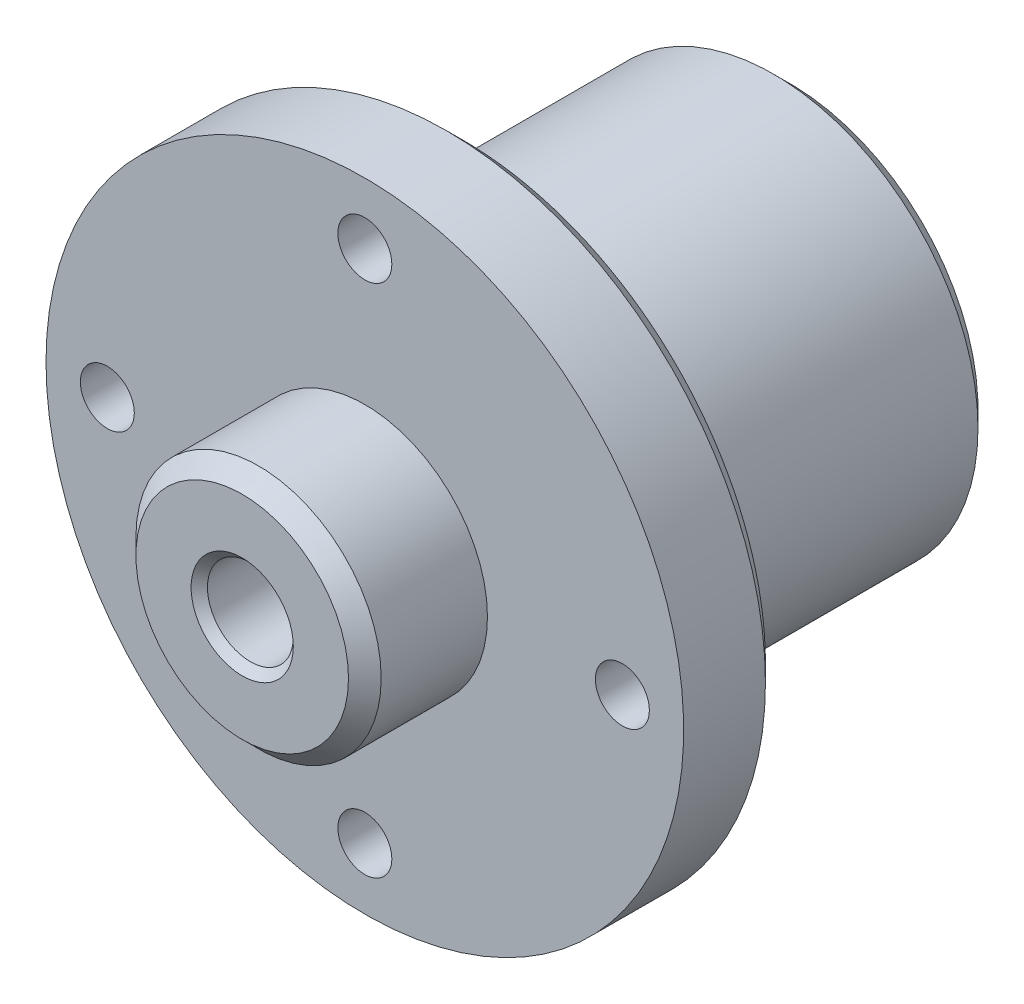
ISO-10303-21;
HEADER;
FILE_DESCRIPTION(('STEP AP214'),'2;1');
FILE_NAME('part.step','',(''),(''),'','','');
FILE_SCHEMA(('AUTOMOTIVE_DESIGN { 1 0 10303 214 1 1 1 1 }'));
ENDSEC;
DATA;
#1=APPLICATION_CONTEXT('core data for automotive mechanical design processes');
#2=APPLICATION_PROTOCOL_DEFINITION('international standard','automotive_design',2000,#1);
#3=PRODUCT_CONTEXT('',#1,'mechanical');
#4=PRODUCT('Part','Part','',(#3));
#5=PRODUCT_RELATED_PRODUCT_CATEGORY('part','',(#4));
#6=PRODUCT_DEFINITION_FORMATION('','',#4);
#7=PRODUCT_DEFINITION_CONTEXT('part definition',#1,'design');
#8=PRODUCT_DEFINITION('design','',#6,#7);
#9=PRODUCT_DEFINITION_SHAPE('','',#8);
#10=(LENGTH_UNIT() NAMED_UNIT(*) SI_UNIT(.MILLI.,.METRE.));
#11=(NAMED_UNIT(*) PLANE_ANGLE_UNIT() SI_UNIT($,.RADIAN.));
#12=(NAMED_UNIT(*) SI_UNIT($,.STERADIAN.) SOLID_ANGLE_UNIT());
#13=UNCERTAINTY_MEASURE_WITH_UNIT(LENGTH_MEASURE(1.E-05),#10,'distance_accuracy_value','');
#14=(GEOMETRIC_REPRESENTATION_CONTEXT(3) GLOBAL_UNCERTAINTY_ASSIGNED_CONTEXT((#13)) GLOBAL_UNIT_ASSIGNED_CONTEXT((#10,
#11,#12)) REPRESENTATION_CONTEXT('',''));
#15=CARTESIAN_POINT('',(0.,0.,0.));
#16=DIRECTION('',(0.,0.,1.));
#17=DIRECTION('',(1.,0.,0.));
#18=AXIS2_PLACEMENT_3D('',#15,#16,#17);
#19=CARTESIAN_POINT('',(0.,0.,-54.6973544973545));
#20=DIRECTION('',(0.,0.,-1.));
#21=DIRECTION('',(-1.,0.,0.));
#22=AXIS2_PLACEMENT_3D('',#19,#20,#21);
#23=CYLINDRICAL_SURFACE('',#22,5.24999999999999);
#24=CARTESIAN_POINT('',(0.,0.,14.));
#25=DIRECTION('',(0.,0.,1.));
#26=DIRECTION('',(1.,0.,0.));
#27=AXIS2_PLACEMENT_3D('',#24,#25,#26);
#28=CIRCLE('',#27,5.24999999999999);
#29=CARTESIAN_POINT('',(5.25000000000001,0.,14.));
#30=VERTEX_POINT('',#29);
#31=EDGE_CURVE('E44',#30,#30,#28,.T.);
#32=ORIENTED_EDGE('',*,*,#31,.T.);
#33=EDGE_LOOP('',(#32));
#34=FACE_BOUND('',#33,.T.);
#35=CARTESIAN_POINT('',(0.,0.,-51.));
#36=DIRECTION('',(0.,0.,-1.));
#37=DIRECTION('',(-1.,0.,0.));
#38=AXIS2_PLACEMENT_3D('',#35,#36,#37);
#39=CIRCLE('',#38,5.24999999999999);
#40=CARTESIAN_POINT('',(-5.25000000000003,0.,-51.));
#41=VERTEX_POINT('',#40);
#42=EDGE_CURVE('E117',#41,#41,#39,.T.);
#43=ORIENTED_EDGE('',*,*,#42,.T.);
#44=EDGE_LOOP('',(#43));
#45=FACE_BOUND('',#44,.T.);
#46=ADVANCED_FACE('F36',(#34,#45),#23,.F.);
#47=CARTESIAN_POINT('',(-5.25000000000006,0.,-52.));
#48=DIRECTION('',(0.,0.,-1.));
#49=DIRECTION('',(-1.,0.,0.));
#50=AXIS2_PLACEMENT_3D('',#47,#48,#49);
#51=PLANE('',#50);
#52=CARTESIAN_POINT('',(0.,0.,-52.));
#53=DIRECTION('',(0.,0.,-1.));
#54=DIRECTION('',(-1.,0.,0.));
#55=AXIS2_PLACEMENT_3D('',#52,#53,#54);
#56=CIRCLE('',#55,6.25);
#57=CARTESIAN_POINT('',(-6.25000000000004,0.,-52.));
#58=VERTEX_POINT('',#57);
#59=EDGE_CURVE('E11',#58,#58,#56,.F.);
#60=ORIENTED_EDGE('',*,*,#59,.T.);
#61=EDGE_LOOP('',(#60));
#62=FACE_BOUND('',#61,.T.);
#63=CARTESIAN_POINT('',(0.,0.,-52.));
#64=DIRECTION('',(0.,0.,-1.));
#65=DIRECTION('',(-1.,0.,0.));
#66=AXIS2_PLACEMENT_3D('',#63,#64,#65);
#67=CIRCLE('',#66,23.);
#68=CARTESIAN_POINT('',(-23.,1.49545661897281E-13,-52.));
#69=VERTEX_POINT('',#68);
#70=EDGE_CURVE('E108',#69,#69,#67,.T.);
#71=ORIENTED_EDGE('',*,*,#70,.T.);
#72=EDGE_LOOP('',(#71));
#73=FACE_BOUND('',#72,.T.);
#74=ADVANCED_FACE('F164',(#62,#73),#51,.T.);
#75=CARTESIAN_POINT('',(0.,0.,-54.6973544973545));
#76=DIRECTION('',(0.,0.,-1.));
#77=DIRECTION('',(-1.,0.,0.));
#78=AXIS2_PLACEMENT_3D('',#75,#76,#77);
#79=CYLINDRICAL_SURFACE('',#78,25.);
#80=CARTESIAN_POINT('',(0.,0.,-50.));
#81=DIRECTION('',(0.,0.,-1.));
#82=DIRECTION('',(-1.,0.,0.));
#83=AXIS2_PLACEMENT_3D('',#80,#81,#82);
#84=CIRCLE('',#83,25.);
#85=CARTESIAN_POINT('',(-25.0000000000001,1.59166224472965E-13,-50.));
#86=VERTEX_POINT('',#85);
#87=EDGE_CURVE('E111',#86,#86,#84,.F.);
#88=ORIENTED_EDGE('',*,*,#87,.T.);
#89=EDGE_LOOP('',(#88));
#90=FACE_BOUND('',#89,.T.);
#91=CARTESIAN_POINT('',(0.,0.,-12.));
#92=DIRECTION('',(0.,0.,-1.));
#93=DIRECTION('',(-1.,0.,0.));
#94=AXIS2_PLACEMENT_3D('',#91,#92,#93);
#95=CIRCLE('',#94,25.);
#96=CARTESIAN_POINT('',(-25.,1.39452233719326E-13,-12.));
#97=VERTEX_POINT('',#96);
#98=EDGE_CURVE('E75',#97,#97,#95,.T.);
#99=ORIENTED_EDGE('',*,*,#98,.T.);
#100=EDGE_LOOP('',(#99));
#101=FACE_BOUND('',#100,.T.);
#102=ADVANCED_FACE('F169',(#90,#101),#79,.T.);
#103=CARTESIAN_POINT('',(-25.0000000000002,1.60108810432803E-13,-12.));
#104=DIRECTION('',(0.,0.,-1.));
#105=DIRECTION('',(-1.,0.,0.));
#106=AXIS2_PLACEMENT_3D('',#103,#104,#105);
#107=PLANE('',#106);
#108=CARTESIAN_POINT('',(0.,0.,-12.));
#109=DIRECTION('',(0.,0.,-1.));
#110=DIRECTION('',(-1.,0.,0.));
#111=AXIS2_PLACEMENT_3D('',#108,#109,#110);
#112=CIRCLE('',#111,37.);
#113=CARTESIAN_POINT('',(-37.,-1.01834434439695E-13,-12.));
#114=VERTEX_POINT('',#113);
#115=CARTESIAN_POINT('',(0.,37.,-12.));
#116=VERTEX_POINT('',#115);
#117=EDGE_CURVE('E77',#114,#116,#112,.T.);
#118=ORIENTED_EDGE('',*,*,#117,.T.);
#119=CARTESIAN_POINT('',(0.,31.5,-12.));
#120=DIRECTION('',(0.,0.,-1.));
#121=DIRECTION('',(-1.,0.,0.));
#122=AXIS2_PLACEMENT_3D('',#119,#120,#121);
#123=CIRCLE('',#122,5.5);
#124=EDGE_CURVE('E50',#116,#116,#123,.T.);
#125=ORIENTED_EDGE('',*,*,#124,.F.);
#126=CARTESIAN_POINT('',(37.0000000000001,-2.47551206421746E-13,-12.));
#127=VERTEX_POINT('',#126);
#128=EDGE_CURVE('E56',#116,#127,#112,.T.);
#129=ORIENTED_EDGE('',*,*,#128,.T.);
#130=CARTESIAN_POINT('',(31.5,-1.29590010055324E-13,-12.));
#131=DIRECTION('',(0.,0.,-1.));
#132=DIRECTION('',(-1.,0.,0.));
#133=AXIS2_PLACEMENT_3D('',#130,#131,#132);
#134=CIRCLE('',#133,5.5);
#135=EDGE_CURVE('E73',#127,#127,#134,.T.);
#136=ORIENTED_EDGE('',*,*,#135,.F.);
#137=CARTESIAN_POINT('',(2.5451666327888E-13,-37.0000000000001,-12.));
#138=VERTEX_POINT('',#137);
#139=EDGE_CURVE('E65',#127,#138,#112,.T.);
#140=ORIENTED_EDGE('',*,*,#139,.T.);
#141=CARTESIAN_POINT('',(2.26761087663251E-13,-31.5,-12.));
#142=DIRECTION('',(0.,0.,-1.));
#143=DIRECTION('',(-1.,0.,0.));
#144=AXIS2_PLACEMENT_3D('',#141,#142,#143);
#145=CIRCLE('',#144,5.5);
#146=EDGE_CURVE('E71',#138,#138,#145,.T.);
#147=ORIENTED_EDGE('',*,*,#146,.F.);
#148=EDGE_CURVE('E97',#138,#114,#112,.T.);
#149=ORIENTED_EDGE('',*,*,#148,.T.);
#150=CARTESIAN_POINT('',(-31.5,0.,-12.));
#151=DIRECTION('',(0.,0.,-1.));
#152=DIRECTION('',(-1.,0.,0.));
#153=AXIS2_PLACEMENT_3D('',#150,#151,#152);
#154=CIRCLE('',#153,5.5);
#155=EDGE_CURVE('E124',#114,#114,#154,.T.);
#156=ORIENTED_EDGE('',*,*,#155,.F.);
#157=EDGE_LOOP('',(#118,#125,#129,#136,#140,#147,#149,#156));
#158=FACE_BOUND('',#157,.T.);
#159=ORIENTED_EDGE('',*,*,#98,.F.);
#160=EDGE_LOOP('',(#159));
#161=FACE_BOUND('',#160,.T.);
#162=ADVANCED_FACE('F68',(#158,#161),#107,.T.);
#163=CARTESIAN_POINT('',(0.,0.,-54.6973544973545));
#164=DIRECTION('',(0.,0.,-1.));
#165=DIRECTION('',(-1.,0.,0.));
#166=AXIS2_PLACEMENT_3D('',#163,#164,#165);
#167=CYLINDRICAL_SURFACE('',#166,39.);
#168=CARTESIAN_POINT('',(0.,0.,-9.99999999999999));
#169=DIRECTION('',(0.,0.,-1.));
#170=DIRECTION('',(-1.,0.,0.));
#171=AXIS2_PLACEMENT_3D('',#168,#169,#170);
#172=CIRCLE('',#171,39.);
#173=CARTESIAN_POINT('',(-39.,2.13021642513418E-13,-10.));
#174=VERTEX_POINT('',#173);
#175=EDGE_CURVE('E99',#174,#174,#172,.F.);
#176=ORIENTED_EDGE('',*,*,#175,.T.);
#177=EDGE_LOOP('',(#176));
#178=FACE_BOUND('',#177,.T.);
#179=CARTESIAN_POINT('',(0.,0.,0.));
#180=DIRECTION('',(0.,0.,-1.));
#181=DIRECTION('',(-1.,0.,0.));
#182=AXIS2_PLACEMENT_3D('',#179,#180,#181);
#183=CIRCLE('',#182,39.);
#184=CARTESIAN_POINT('',(-39.,2.07833750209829E-13,0.));
#185=VERTEX_POINT('',#184);
#186=EDGE_CURVE('E93',#185,#185,#183,.T.);
#187=ORIENTED_EDGE('',*,*,#186,.T.);
#188=EDGE_LOOP('',(#187));
#189=FACE_BOUND('',#188,.T.);
#190=ADVANCED_FACE('F204',(#178,#189),#167,.T.);
#191=CARTESIAN_POINT('',(-39.0000000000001,0.,0.));
#192=DIRECTION('',(0.,0.,1.));
#193=DIRECTION('',(1.,0.,0.));
#194=AXIS2_PLACEMENT_3D('',#191,#192,#193);
#195=PLANE('',#194);
#196=CARTESIAN_POINT('',(0.,31.5,0.));
#197=DIRECTION('',(0.,0.,1.));
#198=DIRECTION('',(1.,0.,0.));
#199=AXIS2_PLACEMENT_3D('',#196,#197,#198);
#200=CIRCLE('',#199,3.3);
#201=CARTESIAN_POINT('',(3.29999999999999,31.5,0.));
#202=VERTEX_POINT('',#201);
#203=EDGE_CURVE('E39',#202,#202,#200,.T.);
#204=ORIENTED_EDGE('',*,*,#203,.F.);
#205=EDGE_LOOP('',(#204));
#206=FACE_BOUND('',#205,.T.);
#207=CARTESIAN_POINT('',(31.5,-1.29590010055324E-13,0.));
#208=DIRECTION('',(0.,0.,1.));
#209=DIRECTION('',(1.,0.,0.));
#210=AXIS2_PLACEMENT_3D('',#207,#208,#209);
#211=CIRCLE('',#210,3.3);
#212=CARTESIAN_POINT('',(34.8,-1.47175942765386E-13,0.));
#213=VERTEX_POINT('',#212);
#214=EDGE_CURVE('E125',#213,#213,#211,.T.);
#215=ORIENTED_EDGE('',*,*,#214,.F.);
#216=EDGE_LOOP('',(#215));
#217=FACE_BOUND('',#216,.T.);
#218=CARTESIAN_POINT('',(-31.5,0.,0.));
#219=DIRECTION('',(0.,0.,1.));
#220=DIRECTION('',(1.,0.,0.));
#221=AXIS2_PLACEMENT_3D('',#218,#219,#220);
#222=CIRCLE('',#221,3.3);
#223=CARTESIAN_POINT('',(-28.2,0.,0.));
#224=VERTEX_POINT('',#223);
#225=EDGE_CURVE('E122',#224,#224,#222,.T.);
#226=ORIENTED_EDGE('',*,*,#225,.F.);
#227=EDGE_LOOP('',(#226));
#228=FACE_BOUND('',#227,.T.);
#229=CARTESIAN_POINT('',(2.26761087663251E-13,-31.5,0.));
#230=DIRECTION('',(0.,0.,1.));
#231=DIRECTION('',(1.,0.,0.));
#232=AXIS2_PLACEMENT_3D('',#229,#230,#231);
#233=CIRCLE('',#232,3.3);
#234=CARTESIAN_POINT('',(3.30000000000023,-31.5000000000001,0.));
#235=VERTEX_POINT('',#234);
#236=EDGE_CURVE('E80',#235,#235,#233,.T.);
#237=ORIENTED_EDGE('',*,*,#236,.F.);
#238=EDGE_LOOP('',(#237));
#239=FACE_BOUND('',#238,.T.);
#240=CARTESIAN_POINT('',(0.,0.,0.));
#241=DIRECTION('',(0.,0.,-1.));
#242=DIRECTION('',(-1.,0.,0.));
#243=AXIS2_PLACEMENT_3D('',#240,#241,#242);
#244=CIRCLE('',#243,15.);
#245=CARTESIAN_POINT('',(-15.,0.,0.));
#246=VERTEX_POINT('',#245);
#247=EDGE_CURVE('E84',#246,#246,#244,.T.);
#248=ORIENTED_EDGE('',*,*,#247,.T.);
#249=EDGE_LOOP('',(#248));
#250=FACE_BOUND('',#249,.T.);
#251=ORIENTED_EDGE('',*,*,#186,.F.);
#252=EDGE_LOOP('',(#251));
#253=FACE_BOUND('',#252,.T.);
#254=ADVANCED_FACE('F198',(#206,#217,#228,#239,#250,#253),#195,.T.);
#255=CARTESIAN_POINT('',(0.,0.,-54.6973544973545));
#256=DIRECTION('',(0.,0.,-1.));
#257=DIRECTION('',(-1.,0.,0.));
#258=AXIS2_PLACEMENT_3D('',#255,#256,#257);
#259=CYLINDRICAL_SURFACE('',#258,15.);
#260=CARTESIAN_POINT('',(0.,0.,13.));
#261=DIRECTION('',(0.,0.,1.));
#262=DIRECTION('',(1.,0.,0.));
#263=AXIS2_PLACEMENT_3D('',#260,#261,#262);
#264=CIRCLE('',#263,15.);
#265=CARTESIAN_POINT('',(15.,0.,13.));
#266=VERTEX_POINT('',#265);
#267=EDGE_CURVE('E102',#266,#266,#264,.F.);
#268=ORIENTED_EDGE('',*,*,#267,.T.);
#269=EDGE_LOOP('',(#268));
#270=FACE_BOUND('',#269,.T.);
#271=ORIENTED_EDGE('',*,*,#247,.F.);
#272=EDGE_LOOP('',(#271));
#273=FACE_BOUND('',#272,.T.);
#274=ADVANCED_FACE('F186',(#270,#273),#259,.T.);
#275=CARTESIAN_POINT('',(-15.,0.,15.));
#276=DIRECTION('',(0.,0.,1.));
#277=DIRECTION('',(1.,0.,0.));
#278=AXIS2_PLACEMENT_3D('',#275,#276,#277);
#279=PLANE('',#278);
#280=CARTESIAN_POINT('',(0.,0.,15.));
#281=DIRECTION('',(0.,0.,1.));
#282=DIRECTION('',(1.,0.,0.));
#283=AXIS2_PLACEMENT_3D('',#280,#281,#282);
#284=CIRCLE('',#283,6.25000000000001);
#285=CARTESIAN_POINT('',(6.25000000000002,0.,15.));
#286=VERTEX_POINT('',#285);
#287=EDGE_CURVE('E114',#286,#286,#284,.F.);
#288=ORIENTED_EDGE('',*,*,#287,.T.);
#289=EDGE_LOOP('',(#288));
#290=FACE_BOUND('',#289,.T.);
#291=CARTESIAN_POINT('',(0.,0.,15.));
#292=DIRECTION('',(0.,0.,1.));
#293=DIRECTION('',(1.,0.,0.));
#294=AXIS2_PLACEMENT_3D('',#291,#292,#293);
#295=CIRCLE('',#294,13.);
#296=CARTESIAN_POINT('',(13.,0.,15.));
#297=VERTEX_POINT('',#296);
#298=EDGE_CURVE('E105',#297,#297,#295,.T.);
#299=ORIENTED_EDGE('',*,*,#298,.T.);
#300=EDGE_LOOP('',(#299));
#301=FACE_BOUND('',#300,.T.);
#302=ADVANCED_FACE('F182',(#290,#301),#279,.T.);
#303=CARTESIAN_POINT('',(0.,0.,-12.));
#304=DIRECTION('',(0.,0.,1.));
#305=DIRECTION('',(1.,0.,0.));
#306=AXIS2_PLACEMENT_3D('',#303,#304,#305);
#307=CONICAL_SURFACE('',#306,37.,0.785398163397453);
#308=ORIENTED_EDGE('',*,*,#175,.F.);
#309=EDGE_LOOP('',(#308));
#310=FACE_BOUND('',#309,.T.);
#311=ORIENTED_EDGE('',*,*,#148,.F.);
#312=ORIENTED_EDGE('',*,*,#139,.F.);
#313=ORIENTED_EDGE('',*,*,#128,.F.);
#314=ORIENTED_EDGE('',*,*,#117,.F.);
#315=EDGE_LOOP('',(#311,#312,#313,#314));
#316=FACE_BOUND('',#315,.T.);
#317=ADVANCED_FACE('F185',(#310,#316),#307,.T.);
#318=CARTESIAN_POINT('',(0.,0.,13.));
#319=DIRECTION('',(0.,0.,-1.));
#320=DIRECTION('',(-1.,0.,0.));
#321=AXIS2_PLACEMENT_3D('',#318,#319,#320);
#322=CONICAL_SURFACE('',#321,15.,0.785398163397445);
#323=ORIENTED_EDGE('',*,*,#298,.F.);
#324=EDGE_LOOP('',(#323));
#325=FACE_BOUND('',#324,.T.);
#326=ORIENTED_EDGE('',*,*,#267,.F.);
#327=EDGE_LOOP('',(#326));
#328=FACE_BOUND('',#327,.T.);
#329=ADVANCED_FACE('F190',(#325,#328),#322,.T.);
#330=CARTESIAN_POINT('',(0.,0.,-52.));
#331=DIRECTION('',(0.,0.,1.));
#332=DIRECTION('',(1.,0.,0.));
#333=AXIS2_PLACEMENT_3D('',#330,#331,#332);
#334=CONICAL_SURFACE('',#333,23.,0.785398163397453);
#335=ORIENTED_EDGE('',*,*,#87,.F.);
#336=EDGE_LOOP('',(#335));
#337=FACE_BOUND('',#336,.T.);
#338=ORIENTED_EDGE('',*,*,#70,.F.);
#339=EDGE_LOOP('',(#338));
#340=FACE_BOUND('',#339,.T.);
#341=ADVANCED_FACE('F178',(#337,#340),#334,.T.);
#342=CARTESIAN_POINT('',(0.,0.,15.));
#343=DIRECTION('',(0.,0.,1.));
#344=DIRECTION('',(1.,0.,0.));
#345=AXIS2_PLACEMENT_3D('',#342,#343,#344);
#346=CONICAL_SURFACE('',#345,6.25,0.785398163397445);
#347=ORIENTED_EDGE('',*,*,#31,.F.);
#348=EDGE_LOOP('',(#347));
#349=FACE_BOUND('',#348,.T.);
#350=ORIENTED_EDGE('',*,*,#287,.F.);
#351=EDGE_LOOP('',(#350));
#352=FACE_BOUND('',#351,.T.);
#353=ADVANCED_FACE('F160',(#349,#352),#346,.F.);
#354=CARTESIAN_POINT('',(0.,0.,-51.));
#355=DIRECTION('',(0.,0.,-1.));
#356=DIRECTION('',(-1.,0.,0.));
#357=AXIS2_PLACEMENT_3D('',#354,#355,#356);
#358=CONICAL_SURFACE('',#357,5.24999999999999,0.785398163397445);
#359=ORIENTED_EDGE('',*,*,#59,.F.);
#360=EDGE_LOOP('',(#359));
#361=FACE_BOUND('',#360,.T.);
#362=ORIENTED_EDGE('',*,*,#42,.F.);
#363=EDGE_LOOP('',(#362));
#364=FACE_BOUND('',#363,.T.);
#365=ADVANCED_FACE('F155',(#361,#364),#358,.F.);
#366=CARTESIAN_POINT('',(2.26761087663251E-13,-31.5,-12.));
#367=DIRECTION('',(0.,0.,-1.));
#368=DIRECTION('',(-1.,0.,0.));
#369=AXIS2_PLACEMENT_3D('',#366,#367,#368);
#370=CYLINDRICAL_SURFACE('',#369,5.5);
#371=CARTESIAN_POINT('',(2.26761087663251E-13,-31.5,-6.00000000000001));
#372=DIRECTION('',(0.,0.,-1.));
#373=DIRECTION('',(-1.,0.,0.));
#374=AXIS2_PLACEMENT_3D('',#371,#372,#373);
#375=CIRCLE('',#374,5.5);
#376=CARTESIAN_POINT('',(-5.49999999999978,-31.5,-6.00000000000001));
#377=VERTEX_POINT('',#376);
#378=EDGE_CURVE('E81',#377,#377,#375,.T.);
#379=ORIENTED_EDGE('',*,*,#378,.F.);
#380=EDGE_LOOP('',(#379));
#381=FACE_BOUND('',#380,.T.);
#382=ORIENTED_EDGE('',*,*,#146,.T.);
#383=EDGE_LOOP('',(#382));
#384=FACE_BOUND('',#383,.T.);
#385=ADVANCED_FACE('F79',(#381,#384),#370,.F.);
#386=CARTESIAN_POINT('',(3.30000000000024,-31.5000000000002,-6.00000000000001));
#387=DIRECTION('',(0.,0.,1.));
#388=DIRECTION('',(1.,0.,0.));
#389=AXIS2_PLACEMENT_3D('',#386,#387,#388);
#390=PLANE('',#389);
#391=CARTESIAN_POINT('',(2.26761087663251E-13,-31.5,-6.00000000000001));
#392=DIRECTION('',(0.,0.,-1.));
#393=DIRECTION('',(-1.,0.,0.));
#394=AXIS2_PLACEMENT_3D('',#391,#392,#393);
#395=CIRCLE('',#394,3.3);
#396=CARTESIAN_POINT('',(-3.29999999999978,-31.5,-6.00000000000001));
#397=VERTEX_POINT('',#396);
#398=EDGE_CURVE('E87',#397,#397,#395,.T.);
#399=ORIENTED_EDGE('',*,*,#398,.F.);
#400=EDGE_LOOP('',(#399));
#401=FACE_BOUND('',#400,.T.);
#402=ORIENTED_EDGE('',*,*,#378,.T.);
#403=EDGE_LOOP('',(#402));
#404=FACE_BOUND('',#403,.T.);
#405=ADVANCED_FACE('F148',(#401,#404),#390,.F.);
#406=CARTESIAN_POINT('',(2.26761087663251E-13,-31.5,-12.));
#407=DIRECTION('',(0.,0.,-1.));
#408=DIRECTION('',(-1.,0.,0.));
#409=AXIS2_PLACEMENT_3D('',#406,#407,#408);
#410=CYLINDRICAL_SURFACE('',#409,3.3);
#411=ORIENTED_EDGE('',*,*,#236,.T.);
#412=EDGE_LOOP('',(#411));
#413=FACE_BOUND('',#412,.T.);
#414=ORIENTED_EDGE('',*,*,#398,.T.);
#415=EDGE_LOOP('',(#414));
#416=FACE_BOUND('',#415,.T.);
#417=ADVANCED_FACE('F146',(#413,#416),#410,.F.);
#418=CARTESIAN_POINT('',(-31.5,0.,-12.));
#419=DIRECTION('',(0.,0.,-1.));
#420=DIRECTION('',(-1.,0.,0.));
#421=AXIS2_PLACEMENT_3D('',#418,#419,#420);
#422=CYLINDRICAL_SURFACE('',#421,5.5);
#423=CARTESIAN_POINT('',(-31.5,0.,-6.00000000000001));
#424=DIRECTION('',(0.,0.,-1.));
#425=DIRECTION('',(-1.,0.,0.));
#426=AXIS2_PLACEMENT_3D('',#423,#424,#425);
#427=CIRCLE('',#426,5.5);
#428=CARTESIAN_POINT('',(-37.,0.,-6.00000000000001));
#429=VERTEX_POINT('',#428);
#430=EDGE_CURVE('E131',#429,#429,#427,.T.);
#431=ORIENTED_EDGE('',*,*,#430,.F.);
#432=EDGE_LOOP('',(#431));
#433=FACE_BOUND('',#432,.T.);
#434=ORIENTED_EDGE('',*,*,#155,.T.);
#435=EDGE_LOOP('',(#434));
#436=FACE_BOUND('',#435,.T.);
#437=ADVANCED_FACE('F241',(#433,#436),#422,.F.);
#438=CARTESIAN_POINT('',(-28.2000000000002,0.,-6.00000000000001));
#439=DIRECTION('',(0.,0.,1.));
#440=DIRECTION('',(1.,0.,0.));
#441=AXIS2_PLACEMENT_3D('',#438,#439,#440);
#442=PLANE('',#441);
#443=CARTESIAN_POINT('',(-31.5,0.,-6.00000000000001));
#444=DIRECTION('',(0.,0.,-1.));
#445=DIRECTION('',(-1.,0.,0.));
#446=AXIS2_PLACEMENT_3D('',#443,#444,#445);
#447=CIRCLE('',#446,3.3);
#448=CARTESIAN_POINT('',(-34.8,0.,-6.00000000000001));
#449=VERTEX_POINT('',#448);
#450=EDGE_CURVE('E127',#449,#449,#447,.T.);
#451=ORIENTED_EDGE('',*,*,#450,.F.);
#452=EDGE_LOOP('',(#451));
#453=FACE_BOUND('',#452,.T.);
#454=ORIENTED_EDGE('',*,*,#430,.T.);
#455=EDGE_LOOP('',(#454));
#456=FACE_BOUND('',#455,.T.);
#457=ADVANCED_FACE('F243',(#453,#456),#442,.F.);
#458=CARTESIAN_POINT('',(-31.5,0.,-12.));
#459=DIRECTION('',(0.,0.,-1.));
#460=DIRECTION('',(-1.,0.,0.));
#461=AXIS2_PLACEMENT_3D('',#458,#459,#460);
#462=CYLINDRICAL_SURFACE('',#461,3.3);
#463=ORIENTED_EDGE('',*,*,#225,.T.);
#464=EDGE_LOOP('',(#463));
#465=FACE_BOUND('',#464,.T.);
#466=ORIENTED_EDGE('',*,*,#450,.T.);
#467=EDGE_LOOP('',(#466));
#468=FACE_BOUND('',#467,.T.);
#469=ADVANCED_FACE('F250',(#465,#468),#462,.F.);
#470=CARTESIAN_POINT('',(31.5,-1.29590010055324E-13,-12.));
#471=DIRECTION('',(0.,0.,-1.));
#472=DIRECTION('',(-1.,0.,0.));
#473=AXIS2_PLACEMENT_3D('',#470,#471,#472);
#474=CYLINDRICAL_SURFACE('',#473,5.5);
#475=CARTESIAN_POINT('',(31.5,-1.29590010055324E-13,-6.00000000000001));
#476=DIRECTION('',(0.,0.,-1.));
#477=DIRECTION('',(-1.,0.,0.));
#478=AXIS2_PLACEMENT_3D('',#475,#476,#477);
#479=CIRCLE('',#478,5.5);
#480=CARTESIAN_POINT('',(26.,-1.00280122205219E-13,-6.00000000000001));
#481=VERTEX_POINT('',#480);
#482=EDGE_CURVE('E133',#481,#481,#479,.T.);
#483=ORIENTED_EDGE('',*,*,#482,.F.);
#484=EDGE_LOOP('',(#483));
#485=FACE_BOUND('',#484,.T.);
#486=ORIENTED_EDGE('',*,*,#135,.T.);
#487=EDGE_LOOP('',(#486));
#488=FACE_BOUND('',#487,.T.);
#489=ADVANCED_FACE('F259',(#485,#488),#474,.F.);
#490=CARTESIAN_POINT('',(34.8000000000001,-2.40612312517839E-13,-6.00000000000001));
#491=DIRECTION('',(0.,0.,1.));
#492=DIRECTION('',(1.,0.,0.));
#493=AXIS2_PLACEMENT_3D('',#490,#491,#492);
#494=PLANE('',#493);
#495=CARTESIAN_POINT('',(31.5,-1.29590010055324E-13,-6.00000000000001));
#496=DIRECTION('',(0.,0.,-1.));
#497=DIRECTION('',(-1.,0.,0.));
#498=AXIS2_PLACEMENT_3D('',#495,#496,#497);
#499=CIRCLE('',#498,3.3);
#500=CARTESIAN_POINT('',(28.2,-1.12004077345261E-13,-6.00000000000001));
#501=VERTEX_POINT('',#500);
#502=EDGE_CURVE('E137',#501,#501,#499,.T.);
#503=ORIENTED_EDGE('',*,*,#502,.F.);
#504=EDGE_LOOP('',(#503));
#505=FACE_BOUND('',#504,.T.);
#506=ORIENTED_EDGE('',*,*,#482,.T.);
#507=EDGE_LOOP('',(#506));
#508=FACE_BOUND('',#507,.T.);
#509=ADVANCED_FACE('F263',(#505,#508),#494,.F.);
#510=CARTESIAN_POINT('',(31.5,-1.29590010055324E-13,-12.));
#511=DIRECTION('',(0.,0.,-1.));
#512=DIRECTION('',(-1.,0.,0.));
#513=AXIS2_PLACEMENT_3D('',#510,#511,#512);
#514=CYLINDRICAL_SURFACE('',#513,3.3);
#515=ORIENTED_EDGE('',*,*,#214,.T.);
#516=EDGE_LOOP('',(#515));
#517=FACE_BOUND('',#516,.T.);
#518=ORIENTED_EDGE('',*,*,#502,.T.);
#519=EDGE_LOOP('',(#518));
#520=FACE_BOUND('',#519,.T.);
#521=ADVANCED_FACE('F267',(#517,#520),#514,.F.);
#522=CARTESIAN_POINT('',(0.,31.5,-12.));
#523=DIRECTION('',(0.,0.,-1.));
#524=DIRECTION('',(-1.,0.,0.));
#525=AXIS2_PLACEMENT_3D('',#522,#523,#524);
#526=CYLINDRICAL_SURFACE('',#525,5.5);
#527=CARTESIAN_POINT('',(0.,31.5,-6.00000000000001));
#528=DIRECTION('',(0.,0.,-1.));
#529=DIRECTION('',(-1.,0.,0.));
#530=AXIS2_PLACEMENT_3D('',#527,#528,#529);
#531=CIRCLE('',#530,5.5);
#532=CARTESIAN_POINT('',(-5.50000000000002,31.5,-6.00000000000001));
#533=VERTEX_POINT('',#532);
#534=EDGE_CURVE('E290',#533,#533,#531,.T.);
#535=ORIENTED_EDGE('',*,*,#534,.F.);
#536=EDGE_LOOP('',(#535));
#537=FACE_BOUND('',#536,.T.);
#538=ORIENTED_EDGE('',*,*,#124,.T.);
#539=EDGE_LOOP('',(#538));
#540=FACE_BOUND('',#539,.T.);
#541=ADVANCED_FACE('F271',(#537,#540),#526,.F.);
#542=CARTESIAN_POINT('',(3.29999999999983,31.5000000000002,-6.00000000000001));
#543=DIRECTION('',(0.,0.,1.));
#544=DIRECTION('',(1.,0.,0.));
#545=AXIS2_PLACEMENT_3D('',#542,#543,#544);
#546=PLANE('',#545);
#547=CARTESIAN_POINT('',(0.,31.5,-6.00000000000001));
#548=DIRECTION('',(0.,0.,-1.));
#549=DIRECTION('',(-1.,0.,0.));
#550=AXIS2_PLACEMENT_3D('',#547,#548,#549);
#551=CIRCLE('',#550,3.3);
#552=CARTESIAN_POINT('',(-3.30000000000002,31.5,-6.00000000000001));
#553=VERTEX_POINT('',#552);
#554=EDGE_CURVE('E289',#553,#553,#551,.T.);
#555=ORIENTED_EDGE('',*,*,#554,.F.);
#556=EDGE_LOOP('',(#555));
#557=FACE_BOUND('',#556,.T.);
#558=ORIENTED_EDGE('',*,*,#534,.T.);
#559=EDGE_LOOP('',(#558));
#560=FACE_BOUND('',#559,.T.);
#561=ADVANCED_FACE('F274',(#557,#560),#546,.F.);
#562=CARTESIAN_POINT('',(0.,31.5,-12.));
#563=DIRECTION('',(0.,0.,-1.));
#564=DIRECTION('',(-1.,0.,0.));
#565=AXIS2_PLACEMENT_3D('',#562,#563,#564);
#566=CYLINDRICAL_SURFACE('',#565,3.3);
#567=ORIENTED_EDGE('',*,*,#203,.T.);
#568=EDGE_LOOP('',(#567));
#569=FACE_BOUND('',#568,.T.);
#570=ORIENTED_EDGE('',*,*,#554,.T.);
#571=EDGE_LOOP('',(#570));
#572=FACE_BOUND('',#571,.T.);
#573=ADVANCED_FACE('F278',(#569,#572),#566,.F.);
#574=CLOSED_SHELL('',(#46,#74,#102,#162,#190,#254,#274,#302,#317,#329,#341,#353,#365,#385,#405,
#417,#437,#457,#469,#489,#509,#521,#541,#561,#573));
#575=MANIFOLD_SOLID_BREP('B2',#574);
#576=ADVANCED_BREP_SHAPE_REPRESENTATION('',(#18,#575),#14);
#577=SHAPE_DEFINITION_REPRESENTATION(#9,#576);
ENDSEC;
END-ISO-10303-21;
